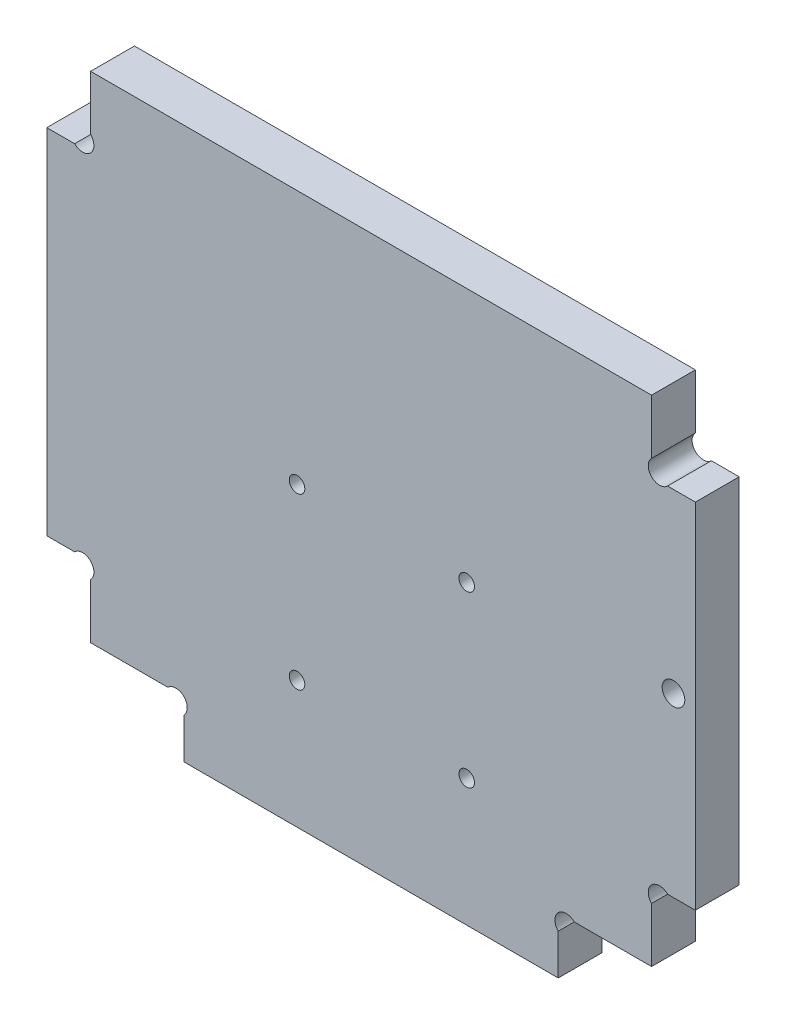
from build123d import *

# Parameters (mm, degrees)
ESQUISSE1_R             = 1.6
EXTRUSION1_DEPTH        = 6.2
ESQUISSE2_R             = 1.1
ENL_V_MAT_EXTRU_1_DEPTH = 7


with BuildPart() as part:
    # Esquisse1 → Extrusion1 (new body)
    with BuildSketch(Plane.XY):
        with BuildLine():
            Line((6.2, 80), (85.55, 80))
            Line((85.55, 80), (85.55, 72.2627417))
            ThreePointArc((85.55, 72.2627417), (85.55, 70), (87.8127417, 70))
            Line((87.8127417, 70), (91.75, 70))
            Line((91.75, 70), (91.75, 20))
            Line((91.75, 20), (87.8127417, 20))
            ThreePointArc((87.8127417, 20), (85.55, 20), (85.55, 17.7372583))
            Line((85.55, 17.7372583), (85.55, 10))
            Line((85.55, 10), (74.6127417, 10))
            ThreePointArc((74.6127417, 10), (72.35, 10), (72.35, 7.7372583))
            Line((72.35, 7.7372583), (72.35, 2))
            Line((72.35, 2), (19.4, 2))
            Line((19.4, 2), (19.4, 7.7372583))
            ThreePointArc((19.4, 7.7372583), (19.4, 10), (17.1372583, 10))
            Line((17.1372583, 10), (6.2, 10))
            Line((6.2, 10), (6.2, 17.7372583))
            ThreePointArc((6.2, 17.7372583), (6.2, 20), (3.9372583, 20))
            Line((3.9372583, 20), (0, 20))
            Line((0, 20), (0, 70))
            Line((0, 70), (3.9372583, 70))
            ThreePointArc((3.9372583, 70), (6.2, 70), (6.2, 72.2627417))
            Line((6.2, 72.2627417), (6.2, 80))
        make_face()
        with Locations(Location((88.65, 45, 0), (0, 0, 180))):
            Circle(ESQUISSE1_R, mode=Mode.SUBTRACT)
    extrude(amount=EXTRUSION1_DEPTH)

    # Esquisse2 → Enl_v. mat.-Extru.1 (cut)
    with BuildSketch(Plane(origin=(0, 0, 0), x_dir=(-1, 0, 0), z_dir=(0, 0, -1))):
        with Locations((-59.4, 20)):
            Circle(ESQUISSE2_R)
        with Locations((-59.4, 44)):
            Circle(ESQUISSE2_R)
        with Locations((-35.4, 44)):
            Circle(ESQUISSE2_R)
        with Locations((-35.4, 20)):
            Circle(ESQUISSE2_R)
    extrude(amount=-ENL_V_MAT_EXTRU_1_DEPTH, mode=Mode.SUBTRACT)


solid = part.part
